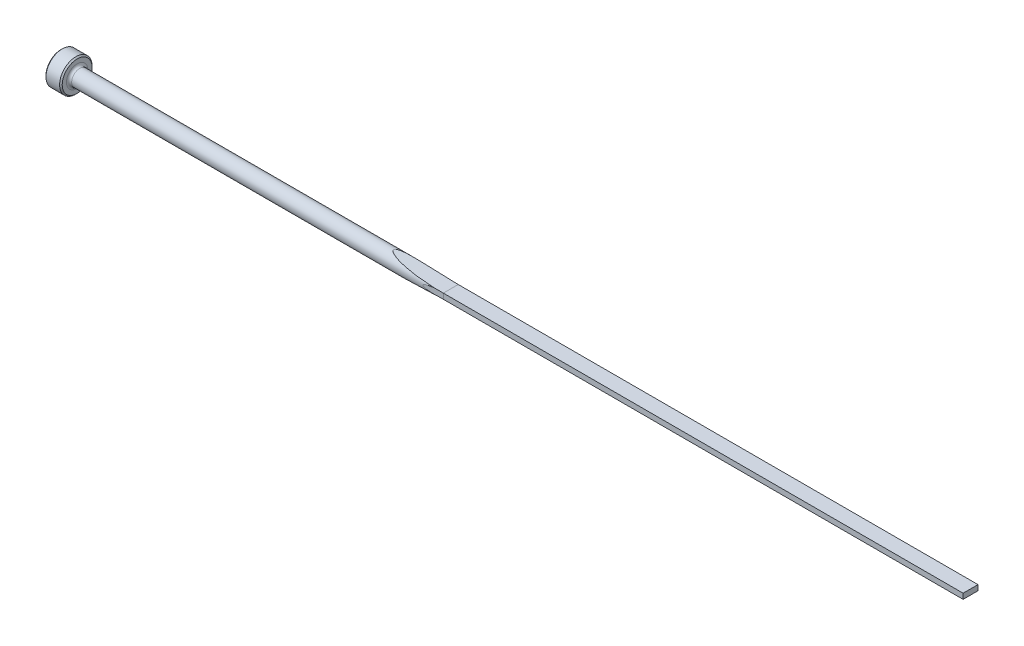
ISO-10303-21;
HEADER;
FILE_DESCRIPTION(('STEP AP214'),'2;1');
FILE_NAME('part.step','',(''),(''),'','','');
FILE_SCHEMA(('AUTOMOTIVE_DESIGN { 1 0 10303 214 1 1 1 1 }'));
ENDSEC;
DATA;
#1=APPLICATION_CONTEXT('core data for automotive mechanical design processes');
#2=APPLICATION_PROTOCOL_DEFINITION('international standard','automotive_design',2000,#1);
#3=PRODUCT_CONTEXT('',#1,'mechanical');
#4=PRODUCT('Part','Part','',(#3));
#5=PRODUCT_RELATED_PRODUCT_CATEGORY('part','',(#4));
#6=PRODUCT_DEFINITION_FORMATION('','',#4);
#7=PRODUCT_DEFINITION_CONTEXT('part definition',#1,'design');
#8=PRODUCT_DEFINITION('design','',#6,#7);
#9=PRODUCT_DEFINITION_SHAPE('','',#8);
#10=(LENGTH_UNIT() NAMED_UNIT(*) SI_UNIT(.MILLI.,.METRE.));
#11=(NAMED_UNIT(*) PLANE_ANGLE_UNIT() SI_UNIT($,.RADIAN.));
#12=(NAMED_UNIT(*) SI_UNIT($,.STERADIAN.) SOLID_ANGLE_UNIT());
#13=UNCERTAINTY_MEASURE_WITH_UNIT(LENGTH_MEASURE(1.E-05),#10,'distance_accuracy_value','');
#14=(GEOMETRIC_REPRESENTATION_CONTEXT(3) GLOBAL_UNCERTAINTY_ASSIGNED_CONTEXT((#13)) GLOBAL_UNIT_ASSIGNED_CONTEXT((#10,
#11,#12)) REPRESENTATION_CONTEXT('',''));
#15=CARTESIAN_POINT('',(0.,0.,0.));
#16=DIRECTION('',(0.,0.,1.));
#17=DIRECTION('',(1.,0.,0.));
#18=AXIS2_PLACEMENT_3D('',#15,#16,#17);
#19=CARTESIAN_POINT('',(0.,0.,0.));
#20=DIRECTION('',(-1.,0.,0.));
#21=DIRECTION('',(0.,0.,1.));
#22=AXIS2_PLACEMENT_3D('',#19,#20,#21);
#23=CYLINDRICAL_SURFACE('',#22,2.3749);
#24=CARTESIAN_POINT('',(5.5118,0.,0.));
#25=DIRECTION('',(-1.,0.,0.));
#26=DIRECTION('',(0.,0.,1.));
#27=AXIS2_PLACEMENT_3D('',#24,#25,#26);
#28=CIRCLE('',#27,2.3749);
#29=CARTESIAN_POINT('',(5.5118,0.,2.3749));
#30=VERTEX_POINT('',#29);
#31=EDGE_CURVE('E152',#30,#30,#28,.F.);
#32=ORIENTED_EDGE('',*,*,#31,.T.);
#33=EDGE_LOOP('',(#32));
#34=FACE_BOUND('',#33,.T.);
#35=CARTESIAN_POINT('',(114.3,0.931958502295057,2.18439999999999));
#36=CARTESIAN_POINT('',(114.107551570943,0.931940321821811,2.18439976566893));
#37=CARTESIAN_POINT('',(113.915101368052,0.930492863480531,2.18502490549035));
#38=CARTESIAN_POINT('',(113.530223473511,0.924611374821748,2.18752450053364));
#39=CARTESIAN_POINT('',(113.337795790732,0.920176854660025,2.18939916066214));
#40=CARTESIAN_POINT('',(112.951834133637,0.9081552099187,2.19441218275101));
#41=CARTESIAN_POINT('',(112.758300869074,0.900548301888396,2.19755847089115));
#42=CARTESIAN_POINT('',(112.371444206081,0.881895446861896,2.20511052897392));
#43=CARTESIAN_POINT('',(112.178120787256,0.87084987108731,2.20951616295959));
#44=CARTESIAN_POINT('',(111.78030053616,0.84410077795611,2.2198794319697));
#45=CARTESIAN_POINT('',(111.575821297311,0.828159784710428,2.22591363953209));
#46=CARTESIAN_POINT('',(111.167312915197,0.79103033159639,2.23937732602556));
#47=CARTESIAN_POINT('',(110.963283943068,0.7698401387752,2.24680726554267));
#48=CARTESIAN_POINT('',(110.55661740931,0.720830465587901,2.26301546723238));
#49=CARTESIAN_POINT('',(110.353977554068,0.693029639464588,2.27178991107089));
#50=CARTESIAN_POINT('',(110.051270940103,0.644172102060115,2.28592867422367));
#51=CARTESIAN_POINT('',(109.950603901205,0.626699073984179,2.29080303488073));
#52=CARTESIAN_POINT('',(109.749867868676,0.588702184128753,2.30086330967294));
#53=CARTESIAN_POINT('',(109.649798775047,0.568178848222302,2.3060491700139));
#54=CARTESIAN_POINT('',(109.501819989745,0.534634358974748,2.31396676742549));
#55=CARTESIAN_POINT('',(109.453550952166,0.523182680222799,2.31658911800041));
#56=CARTESIAN_POINT('',(109.357308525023,0.499097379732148,2.32189592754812));
#57=CARTESIAN_POINT('',(109.309335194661,0.486463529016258,2.32458039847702));
#58=CARTESIAN_POINT('',(109.166352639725,0.44658202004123,2.33269738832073));
#59=CARTESIAN_POINT('',(109.071872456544,0.417265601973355,2.33821536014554));
#60=CARTESIAN_POINT('',(108.945363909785,0.370835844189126,2.34580058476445));
#61=CARTESIAN_POINT('',(108.911833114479,0.357819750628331,2.34783049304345));
#62=CARTESIAN_POINT('',(108.845375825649,0.330089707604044,2.35189084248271));
#63=CARTESIAN_POINT('',(108.81245087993,0.315371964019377,2.35392127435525));
#64=CARTESIAN_POINT('',(108.74666492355,0.283182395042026,2.35801388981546));
#65=CARTESIAN_POINT('',(108.713839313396,0.265637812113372,2.36007502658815));
#66=CARTESIAN_POINT('',(108.650301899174,0.22709417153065,2.36409846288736));
#67=CARTESIAN_POINT('',(108.619581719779,0.206110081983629,2.36606114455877));
#68=CARTESIAN_POINT('',(108.580752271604,0.173632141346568,2.36855971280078));
#69=CARTESIAN_POINT('',(108.570653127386,0.164553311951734,2.36921145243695));
#70=CARTESIAN_POINT('',(108.551335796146,0.145453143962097,2.3704611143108));
#71=CARTESIAN_POINT('',(108.542119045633,0.135430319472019,2.3710589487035));
#72=CARTESIAN_POINT('',(108.524892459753,0.11416272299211,2.372178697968));
#73=CARTESIAN_POINT('',(108.516898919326,0.102904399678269,2.3726995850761));
#74=CARTESIAN_POINT('',(108.502963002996,0.0791761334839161,2.37360916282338));
#75=CARTESIAN_POINT('',(108.497013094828,0.0667108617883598,2.37399833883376));
#76=CARTESIAN_POINT('',(108.489549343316,0.0451214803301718,2.37448695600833));
#77=CARTESIAN_POINT('',(108.487216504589,0.0362843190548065,2.37463982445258));
#78=CARTESIAN_POINT('',(108.484070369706,0.0183429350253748,2.3748460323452));
#79=CARTESIAN_POINT('',(108.48325542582,0.00923901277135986,2.37489947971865));
#80=CARTESIAN_POINT('',(108.483239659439,-0.00898512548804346,2.37490051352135));
#81=CARTESIAN_POINT('',(108.484041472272,-0.0181053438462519,2.37484792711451));
#82=CARTESIAN_POINT('',(108.487168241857,-0.0360804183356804,2.37464298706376));
#83=CARTESIAN_POINT('',(108.489494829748,-0.0449349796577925,2.37449052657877));
#84=CARTESIAN_POINT('',(108.496426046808,-0.0650505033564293,2.37403676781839));
#85=CARTESIAN_POINT('',(108.501530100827,-0.0761364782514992,2.37370288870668));
#86=CARTESIAN_POINT('',(108.51340908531,-0.0973644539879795,2.37292722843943));
#87=CARTESIAN_POINT('',(108.520188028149,-0.10750410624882,2.3724851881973));
#88=CARTESIAN_POINT('',(108.54065261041,-0.134467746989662,2.37115359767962));
#89=CARTESIAN_POINT('',(108.555594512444,-0.150320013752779,2.37018436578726));
#90=CARTESIAN_POINT('',(108.587463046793,-0.179846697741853,2.36812651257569));
#91=CARTESIAN_POINT('',(108.604395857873,-0.193514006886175,2.36703752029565));
#92=CARTESIAN_POINT('',(108.650005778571,-0.226993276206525,2.36411848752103));
#93=CARTESIAN_POINT('',(108.679601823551,-0.245533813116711,2.36223795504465));
#94=CARTESIAN_POINT('',(108.740349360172,-0.279898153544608,2.35841043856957));
#95=CARTESIAN_POINT('',(108.771504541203,-0.295715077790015,2.35646330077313));
#96=CARTESIAN_POINT('',(108.866609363,-0.340418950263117,2.35057165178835));
#97=CARTESIAN_POINT('',(108.931917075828,-0.366382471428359,2.34659497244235));
#98=CARTESIAN_POINT('',(109.074178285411,-0.417382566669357,2.33809504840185));
#99=CARTESIAN_POINT('',(109.151384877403,-0.441669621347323,2.33358126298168));
#100=CARTESIAN_POINT('',(109.306961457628,-0.486276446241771,2.32469268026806));
#101=CARTESIAN_POINT('',(109.385331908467,-0.506594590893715,2.32031794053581));
#102=CARTESIAN_POINT('',(109.621843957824,-0.563416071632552,2.30743335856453));
#103=CARTESIAN_POINT('',(109.78100645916,-0.59566591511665,2.2991859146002));
#104=CARTESIAN_POINT('',(110.100573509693,-0.653182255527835,2.28349651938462));
#105=CARTESIAN_POINT('',(110.260978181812,-0.678448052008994,2.27605464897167));
#106=CARTESIAN_POINT('',(110.582316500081,-0.723854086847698,2.26202300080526));
#107=CARTESIAN_POINT('',(110.743249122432,-0.744001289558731,2.25543207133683));
#108=CARTESIAN_POINT('',(111.168696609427,-0.79200356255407,2.23917011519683));
#109=CARTESIAN_POINT('',(111.433609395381,-0.816543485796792,2.23022625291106));
#110=CARTESIAN_POINT('',(111.964238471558,-0.85775890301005,2.21469349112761));
#111=CARTESIAN_POINT('',(112.229955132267,-0.874429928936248,2.20810593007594));
#112=CARTESIAN_POINT('',(112.761270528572,-0.901186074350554,2.19732116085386));
#113=CARTESIAN_POINT('',(113.026868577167,-0.911283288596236,2.19311956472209));
#114=CARTESIAN_POINT('',(113.558248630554,-0.925643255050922,2.18709742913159));
#115=CARTESIAN_POINT('',(113.82403063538,-0.929906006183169,2.18527689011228));
#116=CARTESIAN_POINT('',(114.159882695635,-0.931763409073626,2.18448280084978));
#117=CARTESIAN_POINT('',(114.229941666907,-0.931956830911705,2.18439997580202));
#118=CARTESIAN_POINT('',(114.3,-0.931958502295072,2.18439999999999));
#119=B_SPLINE_CURVE_WITH_KNOTS('',3,(#35,#36,#37,#38,#39,#40,#41,#42,#43,#44,#45,#46,#47,#48,
#49,#50,#51,#52,#53,#54,#55,#56,#57,#58,#59,#60,#61,#62,#63,#64,#65,#66,#67,#68,#69,#70,#71,#72,
#73,#74,#75,#76,#77,#78,#79,#80,#81,#82,#83,#84,#85,#86,#87,#88,#89,#90,#91,#92,#93,#94,#95,#96,
#97,#98,#99,#100,#101,#102,#103,#104,#105,#106,#107,#108,#109,#110,#111,#112,#113,#114,#115,
#116,#117,#118),.UNSPECIFIED.,.F.,.F.,(4,2,2,2,2,2,2,2,2,2,2,2,2,2,2,2,2,2,2,2,2,2,2,2,2,2,2,2,
2,2,2,2,2,2,2,2,2,2,2,2,2,4),(0.,0.577341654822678,1.15477801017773,1.73587049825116,
2.31690027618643,2.93240275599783,3.54810870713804,4.16209742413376,4.46893047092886,
4.77571068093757,4.9247288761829,5.07377599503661,5.37061535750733,5.47866452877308,
5.58695943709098,5.69870175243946,5.80997010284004,5.85071283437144,5.89152080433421,
5.93283229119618,5.97398983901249,6.00129967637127,6.02857985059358,6.05590452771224,
6.08325848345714,6.11967760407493,6.15618483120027,6.22123367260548,6.2864900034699,
6.39114062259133,6.49605180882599,6.70686384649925,6.94992813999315,7.19309177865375,
7.68061293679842,8.16818297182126,8.65508602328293,9.45349626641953,10.2523593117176,
11.0497483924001,11.8471376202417,12.0573140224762),.UNSPECIFIED.);
#120=CARTESIAN_POINT('',(111.592286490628,0.828645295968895,2.22564529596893));
#121=VERTEX_POINT('',#120);
#122=CARTESIAN_POINT('',(111.592286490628,-0.828645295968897,2.22564529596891));
#123=VERTEX_POINT('',#122);
#124=EDGE_CURVE('E155',#121,#123,#119,.T.);
#125=ORIENTED_EDGE('',*,*,#124,.F.);
#126=CARTESIAN_POINT('',(114.3,0.787400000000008,2.24056940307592));
#127=CARTESIAN_POINT('',(113.903721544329,0.787399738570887,2.24054651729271));
#128=CARTESIAN_POINT('',(113.507442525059,0.790049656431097,2.23963740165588));
#129=CARTESIAN_POINT('',(112.714953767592,0.800648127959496,2.23588274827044));
#130=CARTESIAN_POINT('',(112.318744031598,0.808596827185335,2.23303715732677));
#131=CARTESIAN_POINT('',(111.526988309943,0.829777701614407,2.22525051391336));
#132=CARTESIAN_POINT('',(111.131442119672,0.843003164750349,2.22031212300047));
#133=CARTESIAN_POINT('',(110.340607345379,0.874733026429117,2.20800385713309));
#134=CARTESIAN_POINT('',(109.94531875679,0.893237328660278,2.20063402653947));
#135=CARTESIAN_POINT('',(108.965755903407,0.945648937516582,2.17877563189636));
#136=CARTESIAN_POINT('',(108.381683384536,0.98268826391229,2.16256812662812));
#137=CARTESIAN_POINT('',(107.214572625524,1.06827621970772,2.12160562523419));
#138=CARTESIAN_POINT('',(106.631534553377,1.11682657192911,2.0968493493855));
#139=CARTESIAN_POINT('',(105.757404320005,1.19830432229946,2.0506527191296));
#140=CARTESIAN_POINT('',(105.465670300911,1.22695410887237,2.03371187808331));
#141=CARTESIAN_POINT('',(104.882734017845,1.28711182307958,1.99618545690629));
#142=CARTESIAN_POINT('',(104.591531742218,1.31861968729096,1.97559995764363));
#143=CARTESIAN_POINT('',(104.00988371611,1.38446040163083,1.93003162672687));
#144=CARTESIAN_POINT('',(103.719437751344,1.41879233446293,1.90505021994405));
#145=CARTESIAN_POINT('',(103.139412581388,1.49025344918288,1.84968714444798));
#146=CARTESIAN_POINT('',(102.849833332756,1.52738248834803,1.81930575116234));
#147=CARTESIAN_POINT('',(102.270710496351,1.60453073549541,1.75164925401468));
#148=CARTESIAN_POINT('',(101.981171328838,1.64456050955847,1.71434808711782));
#149=CARTESIAN_POINT('',(101.403547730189,1.72731449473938,1.63095593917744));
#150=CARTESIAN_POINT('',(101.115464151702,1.77004012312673,1.58486030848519));
#151=CARTESIAN_POINT('',(100.686092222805,1.83586423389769,1.50694505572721));
#152=CARTESIAN_POINT('',(100.543846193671,1.85802641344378,1.47960554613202));
#153=CARTESIAN_POINT('',(100.26017261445,1.90292609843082,1.4214005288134));
#154=CARTESIAN_POINT('',(100.118745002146,1.92566355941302,1.39053529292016));
#155=CARTESIAN_POINT('',(99.8370985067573,1.9716384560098,1.32454058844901));
#156=CARTESIAN_POINT('',(99.6968786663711,1.9948754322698,1.28941491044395));
#157=CARTESIAN_POINT('',(99.4179807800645,2.0417755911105,1.21379274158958));
#158=CARTESIAN_POINT('',(99.2793023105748,2.06543865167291,1.17329776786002));
#159=CARTESIAN_POINT('',(99.0807805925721,2.09979130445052,1.10973652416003));
#160=CARTESIAN_POINT('',(99.0200099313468,2.11037294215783,1.08951096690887));
#161=CARTESIAN_POINT('',(98.8990341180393,2.13156622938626,1.0474382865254));
#162=CARTESIAN_POINT('',(98.8388290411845,2.14217788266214,1.02559095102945));
#163=CARTESIAN_POINT('',(98.6585095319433,2.17415135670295,0.956979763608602));
#164=CARTESIAN_POINT('',(98.5394227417,2.19552496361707,0.907374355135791));
#165=CARTESIAN_POINT('',(98.3637071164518,2.22741941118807,0.824398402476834));
#166=CARTESIAN_POINT('',(98.3052030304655,2.23810092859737,0.795064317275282));
#167=CARTESIAN_POINT('',(98.1900770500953,2.25923637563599,0.732861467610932));
#168=CARTESIAN_POINT('',(98.1334540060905,2.26969044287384,0.699994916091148));
#169=CARTESIAN_POINT('',(98.0234199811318,2.29011141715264,0.629970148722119));
#170=CARTESIAN_POINT('',(97.9699878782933,2.30008142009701,0.592846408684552));
#171=CARTESIAN_POINT('',(97.8676678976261,2.31926429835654,0.512705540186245));
#172=CARTESIAN_POINT('',(97.8187652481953,2.3284796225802,0.469708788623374));
#173=CARTESIAN_POINT('',(97.7471099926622,2.3420361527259,0.394736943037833));
#174=CARTESIAN_POINT('',(97.7217809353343,2.3468411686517,0.365338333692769));
#175=CARTESIAN_POINT('',(97.6753414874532,2.35566875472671,0.303242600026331));
#176=CARTESIAN_POINT('',(97.6542235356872,2.35969272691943,0.270551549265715));
#177=CARTESIAN_POINT('',(97.6230616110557,2.36563920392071,0.2110361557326));
#178=CARTESIAN_POINT('',(97.6115671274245,2.36783576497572,0.185009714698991));
#179=CARTESIAN_POINT('',(97.5928564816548,2.3714137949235,0.131397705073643));
#180=CARTESIAN_POINT('',(97.5856352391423,2.37279623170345,0.103814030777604));
#181=CARTESIAN_POINT('',(97.5762520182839,2.37459292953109,0.0475009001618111));
#182=CARTESIAN_POINT('',(97.5741329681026,2.37499897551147,0.0187637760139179));
#183=CARTESIAN_POINT('',(97.5753822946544,2.3747596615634,-0.0385862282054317));
#184=CARTESIAN_POINT('',(97.5787510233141,2.37411423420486,-0.067199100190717));
#185=CARTESIAN_POINT('',(97.5898415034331,2.37199111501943,-0.120132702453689));
#186=CARTESIAN_POINT('',(97.597030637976,2.37061527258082,-0.144574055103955));
#187=CARTESIAN_POINT('',(97.6147206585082,2.36723317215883,-0.192163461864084));
#188=CARTESIAN_POINT('',(97.6252228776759,2.36522666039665,-0.215310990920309));
#189=CARTESIAN_POINT('',(97.6574883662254,2.35906993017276,-0.276517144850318));
#190=CARTESIAN_POINT('',(97.6818770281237,2.35442379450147,-0.313132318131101));
#191=CARTESIAN_POINT('',(97.7357288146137,2.34419374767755,-0.382276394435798));
#192=CARTESIAN_POINT('',(97.7652097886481,2.33860653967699,-0.414790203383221));
#193=CARTESIAN_POINT('',(97.8348005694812,2.32545899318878,-0.483623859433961));
#194=CARTESIAN_POINT('',(97.8757755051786,2.31774444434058,-0.519026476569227));
#195=CARTESIAN_POINT('',(97.9608757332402,2.30178960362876,-0.585738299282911));
#196=CARTESIAN_POINT('',(98.0050067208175,2.29354836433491,-0.617039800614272));
#197=CARTESIAN_POINT('',(98.0955535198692,2.27671389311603,-0.676522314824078));
#198=CARTESIAN_POINT('',(98.1419794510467,2.26811913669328,-0.704687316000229));
#199=CARTESIAN_POINT('',(98.2362489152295,2.25074749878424,-0.758338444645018));
#200=CARTESIAN_POINT('',(98.2840911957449,2.24197078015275,-0.783826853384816));
#201=CARTESIAN_POINT('',(98.416043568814,2.21787883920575,-0.850403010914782));
#202=CARTESIAN_POINT('',(98.5012124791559,2.20245295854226,-0.889346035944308));
#203=CARTESIAN_POINT('',(98.6735803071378,2.17150032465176,-0.962445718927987));
#204=CARTESIAN_POINT('',(98.7607804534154,2.15597351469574,-0.996599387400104));
#205=CARTESIAN_POINT('',(98.9367389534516,2.12491827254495,-1.06120661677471));
#206=CARTESIAN_POINT('',(99.025500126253,2.10938990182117,-1.09165247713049));
#207=CARTESIAN_POINT('',(99.2040369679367,2.0784385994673,-1.14948395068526));
#208=CARTESIAN_POINT('',(99.2938127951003,2.06301568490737,-1.17686907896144));
#209=CARTESIAN_POINT('',(99.5646693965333,2.01691696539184,-1.25535259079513));
#210=CARTESIAN_POINT('',(99.7468967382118,1.98647877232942,-1.30264454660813));
#211=CARTESIAN_POINT('',(100.021494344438,1.94150046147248,-1.36799433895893));
#212=CARTESIAN_POINT('',(100.113176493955,1.92663027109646,-1.38883454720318));
#213=CARTESIAN_POINT('',(100.29693494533,1.89712250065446,-1.42887991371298));
#214=CARTESIAN_POINT('',(100.38901123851,1.88248491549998,-1.44808510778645));
#215=CARTESIAN_POINT('',(100.664053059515,1.83920599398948,-1.5032119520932));
#216=CARTESIAN_POINT('',(100.847496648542,1.81092569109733,-1.53703291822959));
#217=CARTESIAN_POINT('',(101.215324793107,1.75540422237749,-1.60014590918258));
#218=CARTESIAN_POINT('',(101.399709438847,1.72816315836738,-1.62943749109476));
#219=CARTESIAN_POINT('',(101.769248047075,1.67475818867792,-1.68428041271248));
#220=CARTESIAN_POINT('',(101.954402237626,1.64859463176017,-1.70983054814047));
#221=CARTESIAN_POINT('',(102.325275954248,1.59738334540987,-1.75776617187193));
#222=CARTESIAN_POINT('',(102.510995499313,1.57233565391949,-1.78015155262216));
#223=CARTESIAN_POINT('',(103.06946383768,1.49881682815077,-1.84334086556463));
#224=CARTESIAN_POINT('',(103.442899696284,1.45205997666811,-1.88008904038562));
#225=CARTESIAN_POINT('',(104.190945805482,1.36323060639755,-1.94544869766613));
#226=CARTESIAN_POINT('',(104.565555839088,1.32115726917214,-1.97406160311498));
#227=CARTESIAN_POINT('',(105.315519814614,1.24176000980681,-2.02494515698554));
#228=CARTESIAN_POINT('',(105.690873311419,1.20443381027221,-2.04721885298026));
#229=CARTESIAN_POINT('',(106.442297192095,1.13454064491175,-2.08676210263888));
#230=CARTESIAN_POINT('',(106.818367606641,1.10197388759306,-2.10403143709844));
#231=CARTESIAN_POINT('',(107.570734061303,1.04164835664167,-2.13453951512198));
#232=CARTESIAN_POINT('',(107.947029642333,1.01388554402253,-2.14778165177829));
#233=CARTESIAN_POINT('',(108.700044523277,0.963147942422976,-2.17100737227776));
#234=CARTESIAN_POINT('',(109.076763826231,0.940173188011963,-2.18099093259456));
#235=CARTESIAN_POINT('',(109.857530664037,0.897546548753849,-2.19889364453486));
#236=CARTESIAN_POINT('',(110.26160217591,0.878250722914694,-2.20661361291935));
#237=CARTESIAN_POINT('',(111.070073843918,0.845173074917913,-2.21949195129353));
#238=CARTESIAN_POINT('',(111.47447404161,0.831392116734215,-2.224649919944));
#239=CARTESIAN_POINT('',(112.282387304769,0.809381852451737,-2.23275524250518));
#240=CARTESIAN_POINT('',(112.685899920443,0.801138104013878,-2.23570834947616));
#241=CARTESIAN_POINT('',(113.492941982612,0.790147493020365,-2.23960283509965));
#242=CARTESIAN_POINT('',(113.896471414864,0.787399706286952,-2.24054455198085));
#243=CARTESIAN_POINT('',(114.3,0.78739999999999,-2.24056940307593));
#244=B_SPLINE_CURVE_WITH_KNOTS('',3,(#126,#127,#128,#129,#130,#131,#132,#133,#134,#135,#136,
#137,#138,#139,#140,#141,#142,#143,#144,#145,#146,#147,#148,#149,#150,#151,#152,#153,#154,#155,
#156,#157,#158,#159,#160,#161,#162,#163,#164,#165,#166,#167,#168,#169,#170,#171,#172,#173,#174,
#175,#176,#177,#178,#179,#180,#181,#182,#183,#184,#185,#186,#187,#188,#189,#190,#191,#192,#193,
#194,#195,#196,#197,#198,#199,#200,#201,#202,#203,#204,#205,#206,#207,#208,#209,#210,#211,#212,
#213,#214,#215,#216,#217,#218,#219,#220,#221,#222,#223,#224,#225,#226,#227,#228,#229,#230,#231,
#232,#233,#234,#235,#236,#237,#238,#239,#240,#241,#242,#243),.UNSPECIFIED.,.F.,.F.,(4,2,2,2,2,2,
2,2,2,2,2,2,2,2,2,2,2,2,2,2,2,2,2,2,2,2,2,2,2,2,2,2,2,2,2,2,2,2,2,2,2,2,2,2,2,2,2,2,2,2,2,2,2,2,
2,2,2,2,4),(0.,1.18882630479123,2.37768526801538,3.56503679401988,4.75236665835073,
6.50861821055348,8.26513278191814,9.14598291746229,10.0268135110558,10.9073591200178,
11.7878598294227,12.6717468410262,13.5561024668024,13.9956730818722,14.4352098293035,
14.8743583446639,15.3133830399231,15.508109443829,15.7028613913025,16.094693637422,
16.2935481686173,16.4922788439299,16.6895007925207,16.8860550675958,17.0031063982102,
17.1199456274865,17.2052508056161,17.2904543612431,17.3763723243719,17.4622957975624,
17.538548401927,17.6148317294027,17.7467745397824,17.8791895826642,18.0429069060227,
18.2069275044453,18.371750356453,18.5364315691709,18.8209439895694,19.1056332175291,
19.3909039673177,19.6762198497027,20.2480830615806,20.5336448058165,20.8192002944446,
21.3851197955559,21.9510945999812,22.5172511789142,23.0834269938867,24.217683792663,
25.3517420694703,26.4852542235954,27.6188160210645,28.7514200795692,29.8840323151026,
31.0978012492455,32.3117602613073,33.522540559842,34.733117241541),.UNSPECIFIED.);
#245=CARTESIAN_POINT('',(111.592286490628,0.828645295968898,-2.22564529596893));
#246=VERTEX_POINT('',#245);
#247=EDGE_CURVE('E105',#121,#246,#244,.T.);
#248=ORIENTED_EDGE('',*,*,#247,.T.);
#249=CARTESIAN_POINT('',(114.3,0.931958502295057,-2.18439999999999));
#250=CARTESIAN_POINT('',(114.107551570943,0.9319403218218,-2.18439976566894));
#251=CARTESIAN_POINT('',(113.915101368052,0.930492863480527,-2.18502490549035));
#252=CARTESIAN_POINT('',(113.530223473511,0.924611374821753,-2.18752450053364));
#253=CARTESIAN_POINT('',(113.337795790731,0.920176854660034,-2.18939916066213));
#254=CARTESIAN_POINT('',(112.951834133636,0.908155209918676,-2.19441218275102));
#255=CARTESIAN_POINT('',(112.758300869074,0.900548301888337,-2.19755847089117));
#256=CARTESIAN_POINT('',(112.37144420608,0.881895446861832,-2.20511052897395));
#257=CARTESIAN_POINT('',(112.178120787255,0.870849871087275,-2.20951616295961));
#258=CARTESIAN_POINT('',(111.780300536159,0.844100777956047,-2.21987943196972));
#259=CARTESIAN_POINT('',(111.57582129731,0.828159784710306,-2.22591363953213));
#260=CARTESIAN_POINT('',(111.167312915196,0.791030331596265,-2.23937732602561));
#261=CARTESIAN_POINT('',(110.963283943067,0.769840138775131,-2.24680726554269));
#262=CARTESIAN_POINT('',(110.55661740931,0.720830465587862,-2.26301546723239));
#263=CARTESIAN_POINT('',(110.353977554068,0.693029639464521,-2.2717899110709));
#264=CARTESIAN_POINT('',(110.051270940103,0.644172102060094,-2.28592867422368));
#265=CARTESIAN_POINT('',(109.950603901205,0.626699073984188,-2.29080303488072));
#266=CARTESIAN_POINT('',(109.749867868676,0.588702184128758,-2.30086330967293));
#267=CARTESIAN_POINT('',(109.649798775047,0.568178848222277,-2.30604917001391));
#268=CARTESIAN_POINT('',(109.501819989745,0.534634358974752,-2.31396676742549));
#269=CARTESIAN_POINT('',(109.453550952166,0.523182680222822,-2.31658911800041));
#270=CARTESIAN_POINT('',(109.357308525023,0.499097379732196,-2.32189592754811));
#271=CARTESIAN_POINT('',(109.309335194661,0.486463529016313,-2.32458039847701));
#272=CARTESIAN_POINT('',(109.166352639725,0.446582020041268,-2.33269738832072));
#273=CARTESIAN_POINT('',(109.071872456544,0.417265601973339,-2.33821536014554));
#274=CARTESIAN_POINT('',(108.945363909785,0.370835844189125,-2.34580058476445));
#275=CARTESIAN_POINT('',(108.911833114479,0.357819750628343,-2.34783049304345));
#276=CARTESIAN_POINT('',(108.845375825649,0.330089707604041,-2.35189084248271));
#277=CARTESIAN_POINT('',(108.81245087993,0.315371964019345,-2.35392127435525));
#278=CARTESIAN_POINT('',(108.74666492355,0.283182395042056,-2.35801388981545));
#279=CARTESIAN_POINT('',(108.713839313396,0.265637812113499,-2.36007502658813));
#280=CARTESIAN_POINT('',(108.650301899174,0.227094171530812,-2.36409846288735));
#281=CARTESIAN_POINT('',(108.619581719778,0.206110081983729,-2.36606114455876));
#282=CARTESIAN_POINT('',(108.580752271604,0.173632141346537,-2.36855971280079));
#283=CARTESIAN_POINT('',(108.570653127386,0.164553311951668,-2.36921145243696));
#284=CARTESIAN_POINT('',(108.551335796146,0.145453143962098,-2.3704611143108));
#285=CARTESIAN_POINT('',(108.542119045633,0.135430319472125,-2.37105894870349));
#286=CARTESIAN_POINT('',(108.524892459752,0.114162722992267,-2.37217869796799));
#287=CARTESIAN_POINT('',(108.516898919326,0.102904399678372,-2.37269958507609));
#288=CARTESIAN_POINT('',(108.502963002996,0.0791761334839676,-2.37360916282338));
#289=CARTESIAN_POINT('',(108.497013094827,0.0667108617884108,-2.37399833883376));
#290=CARTESIAN_POINT('',(108.489549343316,0.0451214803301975,-2.37448695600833));
#291=CARTESIAN_POINT('',(108.487216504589,0.036284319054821,-2.37463982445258));
#292=CARTESIAN_POINT('',(108.484070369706,0.0183429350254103,-2.3748460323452));
#293=CARTESIAN_POINT('',(108.48325542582,0.00923901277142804,-2.37489947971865));
#294=CARTESIAN_POINT('',(108.483239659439,-0.00898512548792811,-2.37490051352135));
#295=CARTESIAN_POINT('',(108.484041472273,-0.0181053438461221,-2.37484792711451));
#296=CARTESIAN_POINT('',(108.487168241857,-0.0360804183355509,-2.37464298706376));
#297=CARTESIAN_POINT('',(108.489494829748,-0.0449349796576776,-2.37449052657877));
#298=CARTESIAN_POINT('',(108.496426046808,-0.0650505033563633,-2.37403676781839));
#299=CARTESIAN_POINT('',(108.501530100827,-0.0761364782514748,-2.37370288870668));
#300=CARTESIAN_POINT('',(108.51340908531,-0.0973644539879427,-2.37292722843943));
#301=CARTESIAN_POINT('',(108.520188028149,-0.10750410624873,-2.37248518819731));
#302=CARTESIAN_POINT('',(108.54065261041,-0.13446774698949,-2.37115359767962));
#303=CARTESIAN_POINT('',(108.555594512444,-0.150320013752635,-2.37018436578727));
#304=CARTESIAN_POINT('',(108.587463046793,-0.179846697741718,-2.3681265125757));
#305=CARTESIAN_POINT('',(108.604395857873,-0.193514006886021,-2.36703752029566));
#306=CARTESIAN_POINT('',(108.65000577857,-0.226993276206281,-2.36411848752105));
#307=CARTESIAN_POINT('',(108.679601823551,-0.245533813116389,-2.36223795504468));
#308=CARTESIAN_POINT('',(108.740349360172,-0.279898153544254,-2.35841043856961));
#309=CARTESIAN_POINT('',(108.771504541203,-0.295715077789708,-2.35646330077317));
#310=CARTESIAN_POINT('',(108.866609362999,-0.340418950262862,-2.35057165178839));
#311=CARTESIAN_POINT('',(108.931917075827,-0.366382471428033,-2.3465949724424));
#312=CARTESIAN_POINT('',(109.07417828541,-0.417382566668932,-2.33809504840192));
#313=CARTESIAN_POINT('',(109.151384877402,-0.441669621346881,-2.33358126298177));
#314=CARTESIAN_POINT('',(109.306961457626,-0.486276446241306,-2.32469268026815));
#315=CARTESIAN_POINT('',(109.385331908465,-0.506594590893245,-2.32031794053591));
#316=CARTESIAN_POINT('',(109.621843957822,-0.56341607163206,-2.30743335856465));
#317=CARTESIAN_POINT('',(109.781006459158,-0.595665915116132,-2.29918591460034));
#318=CARTESIAN_POINT('',(110.10057350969,-0.653182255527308,-2.28349651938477));
#319=CARTESIAN_POINT('',(110.260978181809,-0.678448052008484,-2.27605464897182));
#320=CARTESIAN_POINT('',(110.582316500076,-0.723854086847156,-2.26202300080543));
#321=CARTESIAN_POINT('',(110.743249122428,-0.744001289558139,-2.25543207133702));
#322=CARTESIAN_POINT('',(111.168696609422,-0.792003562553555,-2.23917011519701));
#323=CARTESIAN_POINT('',(111.433609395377,-0.816543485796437,-2.23022625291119));
#324=CARTESIAN_POINT('',(111.964238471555,-0.857758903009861,-2.21469349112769));
#325=CARTESIAN_POINT('',(112.229955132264,-0.874429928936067,-2.20810593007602));
#326=CARTESIAN_POINT('',(112.761270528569,-0.901186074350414,-2.19732116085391));
#327=CARTESIAN_POINT('',(113.026868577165,-0.911283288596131,-2.19311956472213));
#328=CARTESIAN_POINT('',(113.558248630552,-0.92564325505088,-2.1870974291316));
#329=CARTESIAN_POINT('',(113.824030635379,-0.929906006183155,-2.18527689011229));
#330=CARTESIAN_POINT('',(114.159882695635,-0.931763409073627,-2.18448280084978));
#331=CARTESIAN_POINT('',(114.229941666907,-0.931956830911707,-2.18439997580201));
#332=CARTESIAN_POINT('',(114.3,-0.931958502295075,-2.18439999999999));
#333=B_SPLINE_CURVE_WITH_KNOTS('',3,(#249,#250,#251,#252,#253,#254,#255,#256,#257,#258,#259,
#260,#261,#262,#263,#264,#265,#266,#267,#268,#269,#270,#271,#272,#273,#274,#275,#276,#277,#278,
#279,#280,#281,#282,#283,#284,#285,#286,#287,#288,#289,#290,#291,#292,#293,#294,#295,#296,#297,
#298,#299,#300,#301,#302,#303,#304,#305,#306,#307,#308,#309,#310,#311,#312,#313,#314,#315,#316,
#317,#318,#319,#320,#321,#322,#323,#324,#325,#326,#327,#328,#329,#330,#331,#332),.UNSPECIFIED.,
.F.,.F.,(4,2,2,2,2,2,2,2,2,2,2,2,2,2,2,2,2,2,2,2,2,2,2,2,2,2,2,2,2,2,2,2,2,2,2,2,2,2,2,2,2,4),
(0.,0.577341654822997,1.15477801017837,1.73587049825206,2.31690027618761,2.93240275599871,
3.54810870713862,4.16209742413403,4.46893047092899,4.77571068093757,4.92472887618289,
5.07377599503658,5.37061535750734,5.47866452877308,5.58695943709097,5.6987017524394,
5.80997010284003,5.85071283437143,5.89152080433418,5.93283229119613,5.97398983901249,
6.00129967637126,6.02857985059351,6.05590452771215,6.08325848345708,6.11967760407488,
6.15618483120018,6.22123367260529,6.28649000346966,6.3911406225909,6.49605180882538,
6.70686384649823,6.94992813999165,7.19309177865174,7.68061293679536,8.16818297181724,
8.65508602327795,9.45349626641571,10.2523593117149,11.0497483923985,11.8471376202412,
12.0573140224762),.UNSPECIFIED.);
#334=CARTESIAN_POINT('',(111.592286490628,-0.828645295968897,-2.22564529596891));
#335=VERTEX_POINT('',#334);
#336=EDGE_CURVE('E174',#246,#335,#333,.T.);
#337=ORIENTED_EDGE('',*,*,#336,.T.);
#338=CARTESIAN_POINT('',(114.3,-0.787400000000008,2.24056940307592));
#339=CARTESIAN_POINT('',(113.903721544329,-0.787399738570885,2.24054651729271));
#340=CARTESIAN_POINT('',(113.507442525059,-0.790049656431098,2.23963740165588));
#341=CARTESIAN_POINT('',(112.714953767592,-0.800648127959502,2.23588274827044));
#342=CARTESIAN_POINT('',(112.318744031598,-0.808596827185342,2.23303715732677));
#343=CARTESIAN_POINT('',(111.526988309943,-0.829777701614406,2.22525051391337));
#344=CARTESIAN_POINT('',(111.131442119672,-0.843003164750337,2.22031212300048));
#345=CARTESIAN_POINT('',(110.340607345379,-0.874733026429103,2.20800385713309));
#346=CARTESIAN_POINT('',(109.94531875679,-0.893237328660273,2.20063402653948));
#347=CARTESIAN_POINT('',(108.965755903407,-0.945648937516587,2.17877563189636));
#348=CARTESIAN_POINT('',(108.381683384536,-0.982688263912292,2.16256812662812));
#349=CARTESIAN_POINT('',(107.214572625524,-1.06827621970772,2.12160562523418));
#350=CARTESIAN_POINT('',(106.631534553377,-1.11682657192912,2.0968493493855));
#351=CARTESIAN_POINT('',(105.757404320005,-1.19830432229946,2.05065271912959));
#352=CARTESIAN_POINT('',(105.465670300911,-1.22695410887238,2.03371187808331));
#353=CARTESIAN_POINT('',(104.882734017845,-1.28711182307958,1.99618545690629));
#354=CARTESIAN_POINT('',(104.591531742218,-1.31861968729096,1.97559995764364));
#355=CARTESIAN_POINT('',(104.00988371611,-1.38446040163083,1.93003162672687));
#356=CARTESIAN_POINT('',(103.719437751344,-1.41879233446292,1.90505021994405));
#357=CARTESIAN_POINT('',(103.139412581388,-1.49025344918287,1.84968714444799));
#358=CARTESIAN_POINT('',(102.849833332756,-1.52738248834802,1.81930575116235));
#359=CARTESIAN_POINT('',(102.270710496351,-1.60453073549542,1.75164925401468));
#360=CARTESIAN_POINT('',(101.981171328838,-1.64456050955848,1.71434808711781));
#361=CARTESIAN_POINT('',(101.403547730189,-1.72731449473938,1.63095593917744));
#362=CARTESIAN_POINT('',(101.115464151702,-1.77004012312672,1.58486030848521));
#363=CARTESIAN_POINT('',(100.686092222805,-1.8358642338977,1.5069450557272));
#364=CARTESIAN_POINT('',(100.543846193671,-1.8580264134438,1.479605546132));
#365=CARTESIAN_POINT('',(100.26017261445,-1.90292609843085,1.42140052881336));
#366=CARTESIAN_POINT('',(100.118745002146,-1.92566355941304,1.39053529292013));
#367=CARTESIAN_POINT('',(99.8370985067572,-1.97163845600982,1.32454058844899));
#368=CARTESIAN_POINT('',(99.696878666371,-1.99487543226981,1.28941491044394));
#369=CARTESIAN_POINT('',(99.4179807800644,-2.04177559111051,1.21379274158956));
#370=CARTESIAN_POINT('',(99.2793023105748,-2.06543865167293,1.17329776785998));
#371=CARTESIAN_POINT('',(99.0807805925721,-2.09979130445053,1.10973652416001));
#372=CARTESIAN_POINT('',(99.0200099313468,-2.11037294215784,1.08951096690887));
#373=CARTESIAN_POINT('',(98.8990341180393,-2.13156622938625,1.04743828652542));
#374=CARTESIAN_POINT('',(98.8388290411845,-2.14217788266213,1.02559095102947));
#375=CARTESIAN_POINT('',(98.6585095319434,-2.17415135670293,0.956979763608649));
#376=CARTESIAN_POINT('',(98.5394227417,-2.19552496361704,0.907374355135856));
#377=CARTESIAN_POINT('',(98.3637071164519,-2.22741941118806,0.824398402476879));
#378=CARTESIAN_POINT('',(98.3052030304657,-2.23810092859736,0.795064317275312));
#379=CARTESIAN_POINT('',(98.1900770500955,-2.25923637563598,0.732861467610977));
#380=CARTESIAN_POINT('',(98.1334540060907,-2.26969044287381,0.699994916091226));
#381=CARTESIAN_POINT('',(98.0234199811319,-2.2901114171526,0.629970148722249));
#382=CARTESIAN_POINT('',(97.9699878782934,-2.30008142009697,0.592846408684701));
#383=CARTESIAN_POINT('',(97.8676678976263,-2.31926429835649,0.512705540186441));
#384=CARTESIAN_POINT('',(97.8187652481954,-2.32847962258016,0.469708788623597));
#385=CARTESIAN_POINT('',(97.7471099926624,-2.34203615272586,0.394736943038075));
#386=CARTESIAN_POINT('',(97.7217809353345,-2.34684116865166,0.365338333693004));
#387=CARTESIAN_POINT('',(97.6753414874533,-2.35566875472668,0.303242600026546));
#388=CARTESIAN_POINT('',(97.6542235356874,-2.35969272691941,0.270551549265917));
#389=CARTESIAN_POINT('',(97.6230616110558,-2.36563920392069,0.211036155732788));
#390=CARTESIAN_POINT('',(97.6115671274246,-2.3678357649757,0.185009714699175));
#391=CARTESIAN_POINT('',(97.5928564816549,-2.37141379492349,0.131397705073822));
#392=CARTESIAN_POINT('',(97.5856352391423,-2.37279623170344,0.103814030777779));
#393=CARTESIAN_POINT('',(97.5762520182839,-2.37459292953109,0.0475009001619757));
#394=CARTESIAN_POINT('',(97.5741329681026,-2.37499897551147,0.0187637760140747));
#395=CARTESIAN_POINT('',(97.5753822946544,-2.3747596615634,-0.0385862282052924));
#396=CARTESIAN_POINT('',(97.5787510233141,-2.37411423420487,-0.0671991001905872));
#397=CARTESIAN_POINT('',(97.5898415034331,-2.37199111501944,-0.12013270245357));
#398=CARTESIAN_POINT('',(97.597030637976,-2.37061527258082,-0.144574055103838));
#399=CARTESIAN_POINT('',(97.6147206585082,-2.36723317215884,-0.192163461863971));
#400=CARTESIAN_POINT('',(97.6252228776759,-2.36522666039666,-0.215310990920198));
#401=CARTESIAN_POINT('',(97.6574883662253,-2.35906993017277,-0.276517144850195));
#402=CARTESIAN_POINT('',(97.6818770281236,-2.35442379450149,-0.313132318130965));
#403=CARTESIAN_POINT('',(97.7357288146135,-2.34419374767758,-0.382276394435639));
#404=CARTESIAN_POINT('',(97.7652097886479,-2.33860653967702,-0.414790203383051));
#405=CARTESIAN_POINT('',(97.834800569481,-2.32545899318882,-0.483623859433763));
#406=CARTESIAN_POINT('',(97.8757755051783,-2.31774444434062,-0.519026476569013));
#407=CARTESIAN_POINT('',(97.9608757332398,-2.30178960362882,-0.585738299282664));
#408=CARTESIAN_POINT('',(98.0050067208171,-2.29354836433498,-0.617039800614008));
#409=CARTESIAN_POINT('',(98.0955535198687,-2.27671389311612,-0.676522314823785));
#410=CARTESIAN_POINT('',(98.1419794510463,-2.26811913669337,-0.704687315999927));
#411=CARTESIAN_POINT('',(98.2362489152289,-2.25074749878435,-0.758338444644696));
#412=CARTESIAN_POINT('',(98.2840911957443,-2.24197078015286,-0.783826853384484));
#413=CARTESIAN_POINT('',(98.4160435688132,-2.21787883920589,-0.850403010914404));
#414=CARTESIAN_POINT('',(98.501212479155,-2.20245295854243,-0.889346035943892));
#415=CARTESIAN_POINT('',(98.6735803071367,-2.17150032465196,-0.962445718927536));
#416=CARTESIAN_POINT('',(98.7607804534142,-2.15597351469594,-0.996599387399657));
#417=CARTESIAN_POINT('',(98.9367389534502,-2.12491827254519,-1.06120661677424));
#418=CARTESIAN_POINT('',(99.0255001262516,-2.10938990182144,-1.09165247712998));
#419=CARTESIAN_POINT('',(99.204036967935,-2.0784385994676,-1.14948395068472));
#420=CARTESIAN_POINT('',(99.2938127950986,-2.06301568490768,-1.1768690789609));
#421=CARTESIAN_POINT('',(99.5646693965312,-2.01691696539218,-1.25535259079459));
#422=CARTESIAN_POINT('',(99.7468967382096,-1.98647877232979,-1.30264454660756));
#423=CARTESIAN_POINT('',(100.021494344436,-1.9415004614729,-1.36799433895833));
#424=CARTESIAN_POINT('',(100.113176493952,-1.9266302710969,-1.38883454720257));
#425=CARTESIAN_POINT('',(100.296934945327,-1.89712250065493,-1.42887991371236));
#426=CARTESIAN_POINT('',(100.389011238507,-1.88248491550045,-1.44808510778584));
#427=CARTESIAN_POINT('',(100.664053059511,-1.83920599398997,-1.50321195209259));
#428=CARTESIAN_POINT('',(100.847496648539,-1.81092569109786,-1.53703291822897));
#429=CARTESIAN_POINT('',(101.215324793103,-1.75540422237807,-1.60014590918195));
#430=CARTESIAN_POINT('',(101.399709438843,-1.72816315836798,-1.62943749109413));
#431=CARTESIAN_POINT('',(101.76924804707,-1.67475818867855,-1.68428041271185));
#432=CARTESIAN_POINT('',(101.954402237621,-1.64859463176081,-1.70983054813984));
#433=CARTESIAN_POINT('',(102.325275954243,-1.59738334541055,-1.75776617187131));
#434=CARTESIAN_POINT('',(102.510995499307,-1.57233565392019,-1.78015155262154));
#435=CARTESIAN_POINT('',(103.069463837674,-1.49881682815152,-1.84334086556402));
#436=CARTESIAN_POINT('',(103.442899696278,-1.45205997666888,-1.88008904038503));
#437=CARTESIAN_POINT('',(104.190945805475,-1.36323060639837,-1.94544869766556));
#438=CARTESIAN_POINT('',(104.565555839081,-1.32115726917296,-1.97406160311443));
#439=CARTESIAN_POINT('',(105.315519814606,-1.24176000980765,-2.02494515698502));
#440=CARTESIAN_POINT('',(105.690873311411,-1.20443381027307,-2.04721885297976));
#441=CARTESIAN_POINT('',(106.442297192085,-1.1345406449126,-2.08676210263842));
#442=CARTESIAN_POINT('',(106.818367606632,-1.1019738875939,-2.104031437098));
#443=CARTESIAN_POINT('',(107.570734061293,-1.04164835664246,-2.13453951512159));
#444=CARTESIAN_POINT('',(107.947029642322,-1.01388554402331,-2.14778165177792));
#445=CARTESIAN_POINT('',(108.700044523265,-0.963147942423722,-2.17100737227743));
#446=CARTESIAN_POINT('',(109.076763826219,-0.940173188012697,-2.18099093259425));
#447=CARTESIAN_POINT('',(109.857530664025,-0.897546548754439,-2.19889364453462));
#448=CARTESIAN_POINT('',(110.261602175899,-0.878250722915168,-2.20661361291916));
#449=CARTESIAN_POINT('',(111.070073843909,-0.845173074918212,-2.21949195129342));
#450=CARTESIAN_POINT('',(111.474474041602,-0.831392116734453,-2.22464991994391));
#451=CARTESIAN_POINT('',(112.282387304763,-0.809381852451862,-2.23275524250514));
#452=CARTESIAN_POINT('',(112.685899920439,-0.801138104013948,-2.23570834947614));
#453=CARTESIAN_POINT('',(113.49294198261,-0.790147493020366,-2.23960283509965));
#454=CARTESIAN_POINT('',(113.896471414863,-0.787399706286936,-2.24054455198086));
#455=CARTESIAN_POINT('',(114.3,-0.787399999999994,-2.24056940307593));
#456=B_SPLINE_CURVE_WITH_KNOTS('',3,(#338,#339,#340,#341,#342,#343,#344,#345,#346,#347,#348,
#349,#350,#351,#352,#353,#354,#355,#356,#357,#358,#359,#360,#361,#362,#363,#364,#365,#366,#367,
#368,#369,#370,#371,#372,#373,#374,#375,#376,#377,#378,#379,#380,#381,#382,#383,#384,#385,#386,
#387,#388,#389,#390,#391,#392,#393,#394,#395,#396,#397,#398,#399,#400,#401,#402,#403,#404,#405,
#406,#407,#408,#409,#410,#411,#412,#413,#414,#415,#416,#417,#418,#419,#420,#421,#422,#423,#424,
#425,#426,#427,#428,#429,#430,#431,#432,#433,#434,#435,#436,#437,#438,#439,#440,#441,#442,#443,
#444,#445,#446,#447,#448,#449,#450,#451,#452,#453,#454,#455),.UNSPECIFIED.,.F.,.F.,(4,2,2,2,2,2,
2,2,2,2,2,2,2,2,2,2,2,2,2,2,2,2,2,2,2,2,2,2,2,2,2,2,2,2,2,2,2,2,2,2,2,2,2,2,2,2,2,2,2,2,2,2,2,2,
2,2,2,2,4),(0.,1.18882630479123,2.37768526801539,3.56503679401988,4.75236665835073,
6.50861821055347,8.26513278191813,9.14598291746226,10.0268135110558,10.9073591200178,
11.7878598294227,12.6717468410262,13.5561024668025,13.9956730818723,14.4352098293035,
14.8743583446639,15.3133830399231,15.5081094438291,15.7028613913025,16.0946936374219,
16.2935481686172,16.4922788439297,16.6895007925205,16.8860550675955,17.0031063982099,
17.1199456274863,17.2052508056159,17.290454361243,17.3763723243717,17.4622957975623,
17.5385484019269,17.6148317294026,17.7467745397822,17.8791895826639,18.0429069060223,
18.2069275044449,18.3717503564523,18.5364315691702,18.8209439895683,19.1056332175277,
19.390903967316,19.6762198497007,20.2480830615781,20.5336448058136,20.8192002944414,
21.3851197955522,21.9510945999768,22.5172511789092,23.0834269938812,24.2176837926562,
25.3517420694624,26.4852542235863,27.6188160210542,28.7514200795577,29.8840323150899,
31.097801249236,32.311760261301,33.5225405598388,34.733117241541),.UNSPECIFIED.);
#457=EDGE_CURVE('E104',#123,#335,#456,.T.);
#458=ORIENTED_EDGE('',*,*,#457,.F.);
#459=EDGE_LOOP('',(#125,#248,#337,#458));
#460=FACE_BOUND('',#459,.T.);
#461=ADVANCED_FACE('F32',(#34,#460),#23,.T.);
#462=CARTESIAN_POINT('',(266.7,2.3749,0.));
#463=DIRECTION('',(-1.,0.,0.));
#464=DIRECTION('',(0.,0.,1.));
#465=AXIS2_PLACEMENT_3D('',#462,#463,#464);
#466=PLANE('',#465);
#467=DIRECTION('',(0.,1.,0.));
#468=VECTOR('',#467,1.);
#469=CARTESIAN_POINT('',(266.7,-4.7625,2.18440000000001));
#470=LINE('',#469,#468);
#471=CARTESIAN_POINT('',(266.7,-0.787400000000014,2.18440000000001));
#472=VERTEX_POINT('',#471);
#473=CARTESIAN_POINT('',(266.7,0.78740000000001,2.18440000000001));
#474=VERTEX_POINT('',#473);
#475=EDGE_CURVE('E86',#472,#474,#470,.T.);
#476=ORIENTED_EDGE('',*,*,#475,.F.);
#477=DIRECTION('',(0.,0.,1.));
#478=VECTOR('',#477,1.);
#479=CARTESIAN_POINT('',(266.7,-0.787400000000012,0.));
#480=LINE('',#479,#478);
#481=CARTESIAN_POINT('',(266.7,-0.787400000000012,-2.1844));
#482=VERTEX_POINT('',#481);
#483=EDGE_CURVE('E99',#482,#472,#480,.T.);
#484=ORIENTED_EDGE('',*,*,#483,.F.);
#485=DIRECTION('',(0.,1.,0.));
#486=VECTOR('',#485,1.);
#487=CARTESIAN_POINT('',(266.7,-4.7625,-2.18440000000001));
#488=LINE('',#487,#486);
#489=CARTESIAN_POINT('',(266.7,0.787400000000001,-2.18440000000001));
#490=VERTEX_POINT('',#489);
#491=EDGE_CURVE('E55',#482,#490,#488,.T.);
#492=ORIENTED_EDGE('',*,*,#491,.T.);
#493=DIRECTION('',(0.,0.,1.));
#494=VECTOR('',#493,1.);
#495=CARTESIAN_POINT('',(266.7,0.787400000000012,0.));
#496=LINE('',#495,#494);
#497=EDGE_CURVE('E101',#490,#474,#496,.T.);
#498=ORIENTED_EDGE('',*,*,#497,.T.);
#499=EDGE_LOOP('',(#476,#484,#492,#498));
#500=FACE_BOUND('',#499,.T.);
#501=ADVANCED_FACE('F98',(#500),#466,.F.);
#502=CARTESIAN_POINT('',(114.3,89.6874,-4.7625));
#503=DIRECTION('',(0.,0.,1.));
#504=DIRECTION('',(1.,0.,0.));
#505=AXIS2_PLACEMENT_3D('',#502,#503,#504);
#506=CYLINDRICAL_SURFACE('',#505,88.9);
#507=CARTESIAN_POINT('',(114.3,89.6874,91.0844));
#508=DIRECTION('',(0.,-0.707106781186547,0.707106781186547));
#509=DIRECTION('',(0.,0.707106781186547,0.707106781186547));
#510=AXIS2_PLACEMENT_3D('',#507,#508,#509);
#511=ELLIPSE('',#510,125.723585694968,88.9);
#512=CARTESIAN_POINT('',(114.3,0.787400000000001,2.18439999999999));
#513=VERTEX_POINT('',#512);
#514=EDGE_CURVE('E161',#513,#121,#511,.F.);
#515=ORIENTED_EDGE('',*,*,#514,.F.);
#516=DIRECTION('',(0.,0.,1.));
#517=VECTOR('',#516,1.);
#518=CARTESIAN_POINT('',(114.3,0.787399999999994,-4.7625));
#519=LINE('',#518,#517);
#520=CARTESIAN_POINT('',(114.3,0.787400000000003,-2.18439999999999));
#521=VERTEX_POINT('',#520);
#522=EDGE_CURVE('E169',#521,#513,#519,.T.);
#523=ORIENTED_EDGE('',*,*,#522,.F.);
#524=CARTESIAN_POINT('',(114.3,89.6874,-91.0844));
#525=DIRECTION('',(0.,0.707106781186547,0.707106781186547));
#526=DIRECTION('',(0.,-0.707106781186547,0.707106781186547));
#527=AXIS2_PLACEMENT_3D('',#524,#525,#526);
#528=ELLIPSE('',#527,125.723585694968,88.9);
#529=EDGE_CURVE('E168',#521,#246,#528,.F.);
#530=ORIENTED_EDGE('',*,*,#529,.T.);
#531=ORIENTED_EDGE('',*,*,#247,.F.);
#532=EDGE_LOOP('',(#515,#523,#530,#531));
#533=FACE_BOUND('',#532,.T.);
#534=ADVANCED_FACE('F137',(#533),#506,.F.);
#535=CARTESIAN_POINT('',(266.7,0.787400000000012,-4.7625));
#536=DIRECTION('',(0.,-1.,0.));
#537=DIRECTION('',(1.,0.,0.));
#538=AXIS2_PLACEMENT_3D('',#535,#536,#537);
#539=PLANE('',#538);
#540=DIRECTION('',(-1.,0.,0.));
#541=VECTOR('',#540,1.);
#542=CARTESIAN_POINT('',(266.7,0.787400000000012,2.18440000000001));
#543=LINE('',#542,#541);
#544=EDGE_CURVE('E187',#474,#513,#543,.T.);
#545=ORIENTED_EDGE('',*,*,#544,.F.);
#546=ORIENTED_EDGE('',*,*,#497,.F.);
#547=DIRECTION('',(-1.,0.,0.));
#548=VECTOR('',#547,1.);
#549=CARTESIAN_POINT('',(266.7,0.787400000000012,-2.18440000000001));
#550=LINE('',#549,#548);
#551=EDGE_CURVE('E173',#490,#521,#550,.T.);
#552=ORIENTED_EDGE('',*,*,#551,.T.);
#553=ORIENTED_EDGE('',*,*,#522,.T.);
#554=EDGE_LOOP('',(#545,#546,#552,#553));
#555=FACE_BOUND('',#554,.T.);
#556=ADVANCED_FACE('F128',(#555),#539,.F.);
#557=CARTESIAN_POINT('',(114.3,-89.6874,-4.7625));
#558=DIRECTION('',(0.,0.,1.));
#559=DIRECTION('',(1.,0.,0.));
#560=AXIS2_PLACEMENT_3D('',#557,#558,#559);
#561=CYLINDRICAL_SURFACE('',#560,88.9);
#562=DIRECTION('',(0.,0.,1.));
#563=VECTOR('',#562,1.);
#564=CARTESIAN_POINT('',(114.3,-0.787399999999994,-4.7625));
#565=LINE('',#564,#563);
#566=CARTESIAN_POINT('',(114.3,-0.787400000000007,-2.18439999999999));
#567=VERTEX_POINT('',#566);
#568=CARTESIAN_POINT('',(114.3,-0.787399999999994,2.1844));
#569=VERTEX_POINT('',#568);
#570=EDGE_CURVE('E177',#567,#569,#565,.T.);
#571=ORIENTED_EDGE('',*,*,#570,.T.);
#572=CARTESIAN_POINT('',(114.3,-89.6874,91.0844));
#573=DIRECTION('',(0.,0.707106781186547,0.707106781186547));
#574=DIRECTION('',(0.,-0.707106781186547,0.707106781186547));
#575=AXIS2_PLACEMENT_3D('',#572,#573,#574);
#576=ELLIPSE('',#575,125.723585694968,88.9);
#577=EDGE_CURVE('E162',#569,#123,#576,.T.);
#578=ORIENTED_EDGE('',*,*,#577,.T.);
#579=ORIENTED_EDGE('',*,*,#457,.T.);
#580=CARTESIAN_POINT('',(114.3,-89.6874,-91.0844));
#581=DIRECTION('',(0.,-0.707106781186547,0.707106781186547));
#582=DIRECTION('',(0.,0.707106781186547,0.707106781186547));
#583=AXIS2_PLACEMENT_3D('',#580,#581,#582);
#584=ELLIPSE('',#583,125.723585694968,88.9);
#585=EDGE_CURVE('E179',#567,#335,#584,.T.);
#586=ORIENTED_EDGE('',*,*,#585,.F.);
#587=EDGE_LOOP('',(#571,#578,#579,#586));
#588=FACE_BOUND('',#587,.T.);
#589=ADVANCED_FACE('F123',(#588),#561,.F.);
#590=CARTESIAN_POINT('',(266.7,-0.787400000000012,-4.7625));
#591=DIRECTION('',(0.,-1.,0.));
#592=DIRECTION('',(1.,0.,0.));
#593=AXIS2_PLACEMENT_3D('',#590,#591,#592);
#594=PLANE('',#593);
#595=ORIENTED_EDGE('',*,*,#483,.T.);
#596=DIRECTION('',(-1.,0.,0.));
#597=VECTOR('',#596,1.);
#598=CARTESIAN_POINT('',(266.7,-0.787400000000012,2.18440000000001));
#599=LINE('',#598,#597);
#600=EDGE_CURVE('E83',#472,#569,#599,.T.);
#601=ORIENTED_EDGE('',*,*,#600,.T.);
#602=ORIENTED_EDGE('',*,*,#570,.F.);
#603=DIRECTION('',(-1.,0.,0.));
#604=VECTOR('',#603,1.);
#605=CARTESIAN_POINT('',(266.7,-0.787400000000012,-2.18440000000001));
#606=LINE('',#605,#604);
#607=EDGE_CURVE('E93',#482,#567,#606,.T.);
#608=ORIENTED_EDGE('',*,*,#607,.F.);
#609=EDGE_LOOP('',(#595,#601,#602,#608));
#610=FACE_BOUND('',#609,.T.);
#611=ADVANCED_FACE('F103',(#610),#594,.T.);
#612=CARTESIAN_POINT('',(0.,0.,0.));
#613=DIRECTION('',(1.,0.,0.));
#614=DIRECTION('',(0.,0.,-1.));
#615=AXIS2_PLACEMENT_3D('',#612,#613,#614);
#616=PLANE('',#615);
#617=CARTESIAN_POINT('',(0.,0.,0.));
#618=DIRECTION('',(1.,0.,0.));
#619=DIRECTION('',(0.,0.,-1.));
#620=AXIS2_PLACEMENT_3D('',#617,#618,#619);
#621=CIRCLE('',#620,4.38149999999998);
#622=CARTESIAN_POINT('',(0.,0.,-4.38149999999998));
#623=VERTEX_POINT('',#622);
#624=EDGE_CURVE('E238',#623,#623,#621,.F.);
#625=ORIENTED_EDGE('',*,*,#624,.T.);
#626=EDGE_LOOP('',(#625));
#627=FACE_BOUND('',#626,.T.);
#628=ADVANCED_FACE('F135',(#627),#616,.F.);
#629=CARTESIAN_POINT('',(0.,0.,0.));
#630=DIRECTION('',(-1.,0.,0.));
#631=DIRECTION('',(0.,0.,1.));
#632=AXIS2_PLACEMENT_3D('',#629,#630,#631);
#633=CYLINDRICAL_SURFACE('',#632,4.7625);
#634=CARTESIAN_POINT('',(0.38099999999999,0.,0.));
#635=DIRECTION('',(1.,0.,0.));
#636=DIRECTION('',(0.,0.,-1.));
#637=AXIS2_PLACEMENT_3D('',#634,#635,#636);
#638=CIRCLE('',#637,4.7625);
#639=CARTESIAN_POINT('',(0.38099999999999,0.,-4.7625));
#640=VERTEX_POINT('',#639);
#641=EDGE_CURVE('E40',#640,#640,#638,.T.);
#642=ORIENTED_EDGE('',*,*,#641,.T.);
#643=EDGE_LOOP('',(#642));
#644=FACE_BOUND('',#643,.T.);
#645=CARTESIAN_POINT('',(4.36879999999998,0.,0.));
#646=DIRECTION('',(-1.,0.,0.));
#647=DIRECTION('',(0.,0.,1.));
#648=AXIS2_PLACEMENT_3D('',#645,#646,#647);
#649=CIRCLE('',#648,4.7625);
#650=CARTESIAN_POINT('',(4.36879999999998,0.,4.7625));
#651=VERTEX_POINT('',#650);
#652=EDGE_CURVE('E239',#651,#651,#649,.T.);
#653=ORIENTED_EDGE('',*,*,#652,.T.);
#654=EDGE_LOOP('',(#653));
#655=FACE_BOUND('',#654,.T.);
#656=ADVANCED_FACE('F212',(#644,#655),#633,.T.);
#657=CARTESIAN_POINT('',(4.7498,4.7625,0.));
#658=DIRECTION('',(-1.,0.,0.));
#659=DIRECTION('',(0.,0.,1.));
#660=AXIS2_PLACEMENT_3D('',#657,#658,#659);
#661=PLANE('',#660);
#662=CARTESIAN_POINT('',(4.7498,0.,0.));
#663=DIRECTION('',(-1.,0.,0.));
#664=DIRECTION('',(0.,0.,1.));
#665=AXIS2_PLACEMENT_3D('',#662,#663,#664);
#666=CIRCLE('',#665,4.38149999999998);
#667=CARTESIAN_POINT('',(4.7498,0.,4.38149999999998));
#668=VERTEX_POINT('',#667);
#669=EDGE_CURVE('E11',#668,#668,#666,.F.);
#670=ORIENTED_EDGE('',*,*,#669,.T.);
#671=EDGE_LOOP('',(#670));
#672=FACE_BOUND('',#671,.T.);
#673=CARTESIAN_POINT('',(4.7498,0.,0.));
#674=DIRECTION('',(-1.,0.,0.));
#675=DIRECTION('',(0.,0.,1.));
#676=AXIS2_PLACEMENT_3D('',#673,#674,#675);
#677=CIRCLE('',#676,3.1369);
#678=CARTESIAN_POINT('',(4.7498,0.,3.1369));
#679=VERTEX_POINT('',#678);
#680=EDGE_CURVE('E92',#679,#679,#677,.T.);
#681=ORIENTED_EDGE('',*,*,#680,.T.);
#682=EDGE_LOOP('',(#681));
#683=FACE_BOUND('',#682,.T.);
#684=ADVANCED_FACE('F207',(#672,#683),#661,.F.);
#685=CARTESIAN_POINT('',(266.7,-4.7625,-2.18440000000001));
#686=DIRECTION('',(0.,0.,1.));
#687=DIRECTION('',(1.,0.,0.));
#688=AXIS2_PLACEMENT_3D('',#685,#686,#687);
#689=PLANE('',#688);
#690=ORIENTED_EDGE('',*,*,#491,.F.);
#691=ORIENTED_EDGE('',*,*,#607,.T.);
#692=DIRECTION('',(0.,1.,0.));
#693=VECTOR('',#692,1.);
#694=CARTESIAN_POINT('',(114.3,-4.7625,-2.18439999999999));
#695=LINE('',#694,#693);
#696=EDGE_CURVE('E189',#567,#521,#695,.T.);
#697=ORIENTED_EDGE('',*,*,#696,.T.);
#698=ORIENTED_EDGE('',*,*,#551,.F.);
#699=EDGE_LOOP('',(#690,#691,#697,#698));
#700=FACE_BOUND('',#699,.T.);
#701=ADVANCED_FACE('F188',(#700),#689,.F.);
#702=CARTESIAN_POINT('',(114.3,-4.7625,-91.0844));
#703=DIRECTION('',(0.,1.,0.));
#704=DIRECTION('',(0.,0.,1.));
#705=AXIS2_PLACEMENT_3D('',#702,#703,#704);
#706=CYLINDRICAL_SURFACE('',#705,88.9);
#707=ORIENTED_EDGE('',*,*,#696,.F.);
#708=ORIENTED_EDGE('',*,*,#585,.T.);
#709=ORIENTED_EDGE('',*,*,#336,.F.);
#710=ORIENTED_EDGE('',*,*,#529,.F.);
#711=EDGE_LOOP('',(#707,#708,#709,#710));
#712=FACE_BOUND('',#711,.T.);
#713=ADVANCED_FACE('F130',(#712),#706,.F.);
#714=CARTESIAN_POINT('',(114.3,-4.7625,91.0844));
#715=DIRECTION('',(0.,1.,0.));
#716=DIRECTION('',(0.,0.,1.));
#717=AXIS2_PLACEMENT_3D('',#714,#715,#716);
#718=CYLINDRICAL_SURFACE('',#717,88.9);
#719=ORIENTED_EDGE('',*,*,#514,.T.);
#720=ORIENTED_EDGE('',*,*,#124,.T.);
#721=ORIENTED_EDGE('',*,*,#577,.F.);
#722=DIRECTION('',(0.,1.,0.));
#723=VECTOR('',#722,1.);
#724=CARTESIAN_POINT('',(114.3,-4.7625,2.18439999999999));
#725=LINE('',#724,#723);
#726=EDGE_CURVE('E47',#569,#513,#725,.T.);
#727=ORIENTED_EDGE('',*,*,#726,.T.);
#728=EDGE_LOOP('',(#719,#720,#721,#727));
#729=FACE_BOUND('',#728,.T.);
#730=ADVANCED_FACE('F200',(#729),#718,.F.);
#731=CARTESIAN_POINT('',(266.7,-4.7625,2.18440000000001));
#732=DIRECTION('',(0.,0.,1.));
#733=DIRECTION('',(1.,0.,0.));
#734=AXIS2_PLACEMENT_3D('',#731,#732,#733);
#735=PLANE('',#734);
#736=ORIENTED_EDGE('',*,*,#544,.T.);
#737=ORIENTED_EDGE('',*,*,#726,.F.);
#738=ORIENTED_EDGE('',*,*,#600,.F.);
#739=ORIENTED_EDGE('',*,*,#475,.T.);
#740=EDGE_LOOP('',(#736,#737,#738,#739));
#741=FACE_BOUND('',#740,.T.);
#742=ADVANCED_FACE('F85',(#741),#735,.T.);
#743=CARTESIAN_POINT('',(5.5118,0.,0.));
#744=DIRECTION('',(-1.,0.,0.));
#745=DIRECTION('',(0.,0.,1.));
#746=AXIS2_PLACEMENT_3D('',#743,#744,#745);
#747=TOROIDAL_SURFACE('',#746,3.1369,0.762);
#748=ORIENTED_EDGE('',*,*,#31,.F.);
#749=EDGE_LOOP('',(#748));
#750=FACE_BOUND('',#749,.T.);
#751=ORIENTED_EDGE('',*,*,#680,.F.);
#752=EDGE_LOOP('',(#751));
#753=FACE_BOUND('',#752,.T.);
#754=ADVANCED_FACE('F205',(#750,#753),#747,.F.);
#755=CARTESIAN_POINT('',(0.,0.,0.));
#756=DIRECTION('',(1.,0.,0.));
#757=DIRECTION('',(0.,0.,-1.));
#758=AXIS2_PLACEMENT_3D('',#755,#756,#757);
#759=CONICAL_SURFACE('',#758,4.38149999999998,0.785398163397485);
#760=ORIENTED_EDGE('',*,*,#641,.F.);
#761=EDGE_LOOP('',(#760));
#762=FACE_BOUND('',#761,.T.);
#763=ORIENTED_EDGE('',*,*,#624,.F.);
#764=EDGE_LOOP('',(#763));
#765=FACE_BOUND('',#764,.T.);
#766=ADVANCED_FACE('F225',(#762,#765),#759,.T.);
#767=CARTESIAN_POINT('',(4.36879999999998,0.,0.));
#768=DIRECTION('',(-1.,0.,0.));
#769=DIRECTION('',(0.,0.,1.));
#770=AXIS2_PLACEMENT_3D('',#767,#768,#769);
#771=CONICAL_SURFACE('',#770,4.7625,0.785398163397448);
#772=ORIENTED_EDGE('',*,*,#669,.F.);
#773=EDGE_LOOP('',(#772));
#774=FACE_BOUND('',#773,.T.);
#775=ORIENTED_EDGE('',*,*,#652,.F.);
#776=EDGE_LOOP('',(#775));
#777=FACE_BOUND('',#776,.T.);
#778=ADVANCED_FACE('F34',(#774,#777),#771,.T.);
#779=CLOSED_SHELL('',(#461,#501,#534,#556,#589,#611,#628,#656,#684,#701,#713,#730,#742,#754,
#766,#778));
#780=MANIFOLD_SOLID_BREP('B2',#779);
#781=ADVANCED_BREP_SHAPE_REPRESENTATION('',(#18,#780),#14);
#782=SHAPE_DEFINITION_REPRESENTATION(#9,#781);
ENDSEC;
END-ISO-10303-21;
